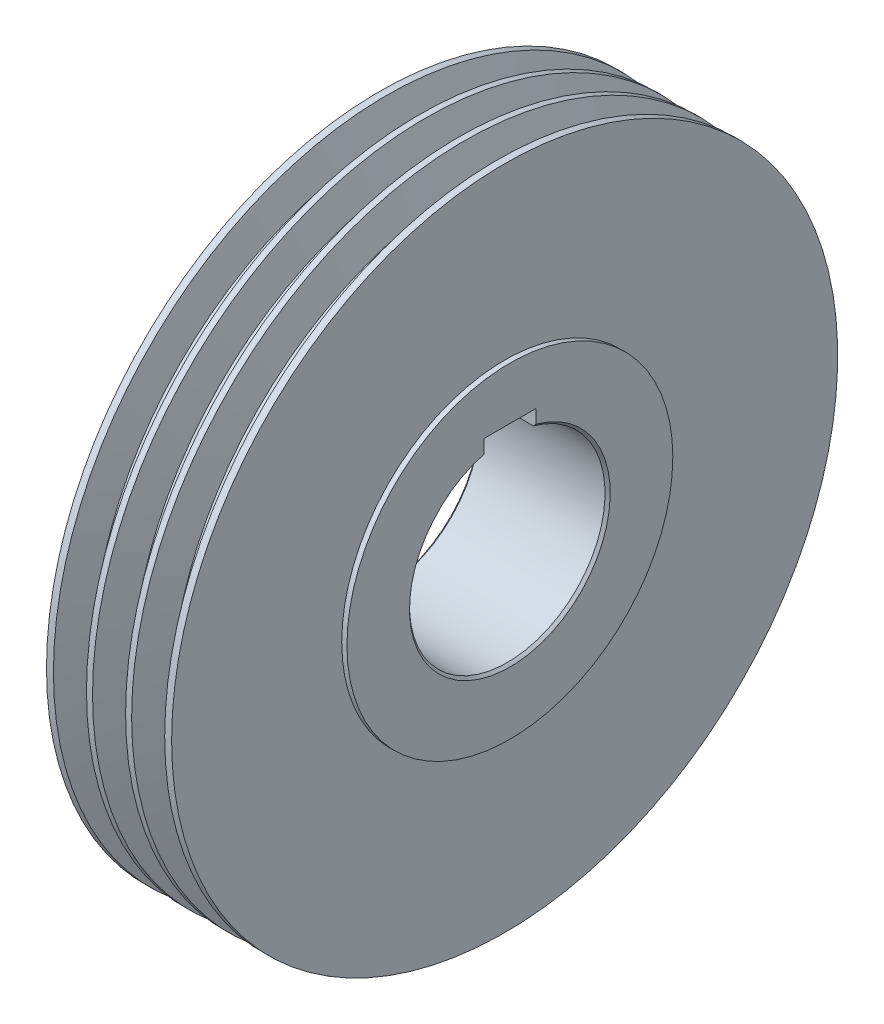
from build123d import *

# Parameters (mm, degrees)
PATTERN_LINEAR_1_COUNT = 3
PATTERN_LINEAR_1_PITCH = 15
CHAMFER_1_SIZE         = 1
SKETCH_4_W             = 20
SKETCH_4_H             = 6.257919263
CUT_EXTRUDE_1_DEPTH    = 188.456995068


with BuildPart() as part:
    # Sketch 1 → Revolve 1 (revolve)
    with BuildSketch(Plane.XY, mode=Mode.PRIVATE) as revolve_1_sk:
        Polygon((0, 37.5), (0, 127.75), (48, 127.75), (48, 62.5), (50, 62.5), (50, 37.5), align=None)
    revolve(revolve_1_sk.sketch.rotate(Axis((0, 0, 0), (1, 0, 0)), 90), axis=Axis((0, 0, 0), (1, 0, 0)))

    # Sketch 2 → Cut-Revolve 1 (revolve, cut)
    with BuildSketch(Plane.XY, mode=Mode.PRIVATE) as cut_revolve_1_sk:
        Polygon((11.840143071, 116.3), (15.340759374, 127.75), (2.659240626, 127.75), (6.159856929, 116.3), align=None)
    cut_revolve_1 = revolve(cut_revolve_1_sk.sketch.rotate(Axis((0, 0, 0), (1, 0, 0)), 90), axis=Axis((0, 0, 0), (1, 0, 0)), mode=Mode.SUBTRACT)

    # Pattern Linear 1: Cut-Revolve 1 ×3
    with Locations(*[(i * PATTERN_LINEAR_1_PITCH, 0, 0) for i in range(1, PATTERN_LINEAR_1_COUNT)]):
        add(cut_revolve_1, mode=Mode.SUBTRACT)

    # Chamfer 1
    chamfer_1_edges = [part.edges().sort_by_distance(p)[0] for p in [
        (50, 0, -37.5),
        (0, 0, -37.5),
    ]]
    chamfer(chamfer_1_edges, length=CHAMFER_1_SIZE)

    # Sketch 4 → Cut-Extrude 1 (cut, through all)
    with BuildSketch(Plane.ZY):
        with Locations((0, 39.271040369)):
            Rectangle(SKETCH_4_W, SKETCH_4_H)
    extrude(amount=-CUT_EXTRUDE_1_DEPTH, mode=Mode.SUBTRACT)


solid = part.part
